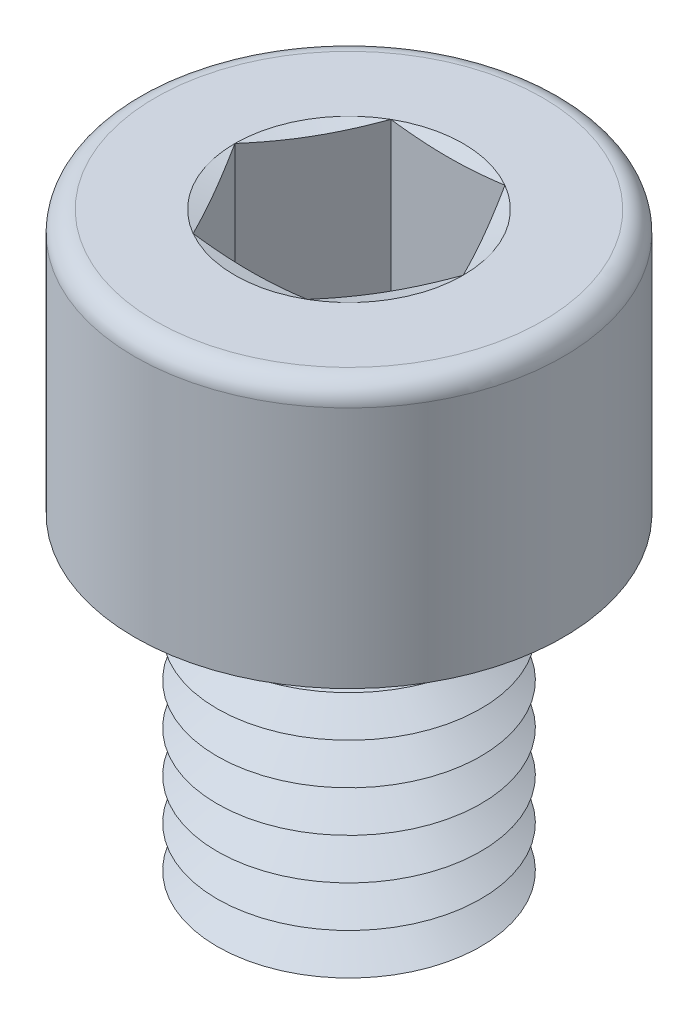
from build123d import *

# Parameters (mm, degrees)
SKETCH1_R       = 4
EXTRUDE1_DEPTH  = 10
SKETCH2_R       = 6.5
EXTRUDE2_DEPTH  = 8
EXTRUDE3_DEPTH  = 6
FILLET1_R       = 0.625
LPATTERN1_COUNT = 8
LPATTERN1_PITCH = 1.25


with BuildPart() as part:
    # Sketch1 → Extrude1 (new body)
    with BuildSketch(Plane(origin=(0, 0, 0), x_dir=(1, 0, 0), z_dir=(0, 1, 0))):
        with Locations(Location((0, 0, 0), (0, 0, 270))):
            Circle(SKETCH1_R)
    extrude(amount=EXTRUDE1_DEPTH)

    # Sketch2 → Extrude2 (add)
    with BuildSketch(Plane(origin=(0, 10, 0), x_dir=(1, 0, 0), z_dir=(0, 1, 0))):
        with Locations(Location((0, 0, 0), (0, 0, 270))):
            Circle(SKETCH2_R)
    extrude(amount=EXTRUDE2_DEPTH)

    # Sketch3 → Extrude3 (cut)
    with BuildSketch(Plane(origin=(0, 18, 0), x_dir=(1, 0, 0), z_dir=(0, 1, 0))):
        Polygon((1.732050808, 3), (-1.732050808, 3), (-3.464101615, 0), (-1.732050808, -3), (1.732050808, -3), (3.464101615, 0), align=None)
    extrude(amount=-EXTRUDE3_DEPTH, mode=Mode.SUBTRACT)

    # Fillet1
    fillet1_edges = [part.edges().sort_by_distance(p)[0] for p in [
        (0, 18, -6.5),
    ]]
    fillet(fillet1_edges, radius=FILLET1_R)

    # Sketch4 → Cut-Revolve1 (revolve, cut)
    with BuildSketch(Plane(origin=(0, 0, 0), x_dir=(0, 0, -1), z_dir=(1, 0, 0))):
        Polygon((-3, 12), (0, 12), (0, 10.267949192), align=None)
    revolve(axis=Axis((0, 12, 0), (0, -1, 0)), mode=Mode.SUBTRACT)

    # Sketch5 → Cut-Revolve2 (revolve, cut)
    with BuildSketch(Plane.XY, mode=Mode.PRIVATE) as cut_revolve2_sk:
        Polygon((-4, 0.625), (-4, -0.625), (-2.917468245, 0), align=None)
    cut_revolve2 = revolve(cut_revolve2_sk.sketch.rotate(Axis((0, 10, 0), (0, -1, 0)), 270), axis=Axis((0, 10, 0), (0, -1, 0)), mode=Mode.SUBTRACT)

    # LPattern1: Cut-Revolve2 ×8
    with Locations(*[(0, i * LPATTERN1_PITCH, 0) for i in range(1, LPATTERN1_COUNT)]):
        add(cut_revolve2, mode=Mode.SUBTRACT)

    # Extrude4 cone 1 section (on through the dimple's axis) → Extrude4 (revolve, cut)
    with BuildSketch(Plane(origin=(0, 18, 0), x_dir=(0, 0, 1), z_dir=(1, 0, 0))):
        Polygon((0, 0), (3.464101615, 0), (0, 0.92820323), align=None)
    revolve(axis=Axis((0, 18, 0), (0, -1, 0)), mode=Mode.SUBTRACT)


solid = part.part
